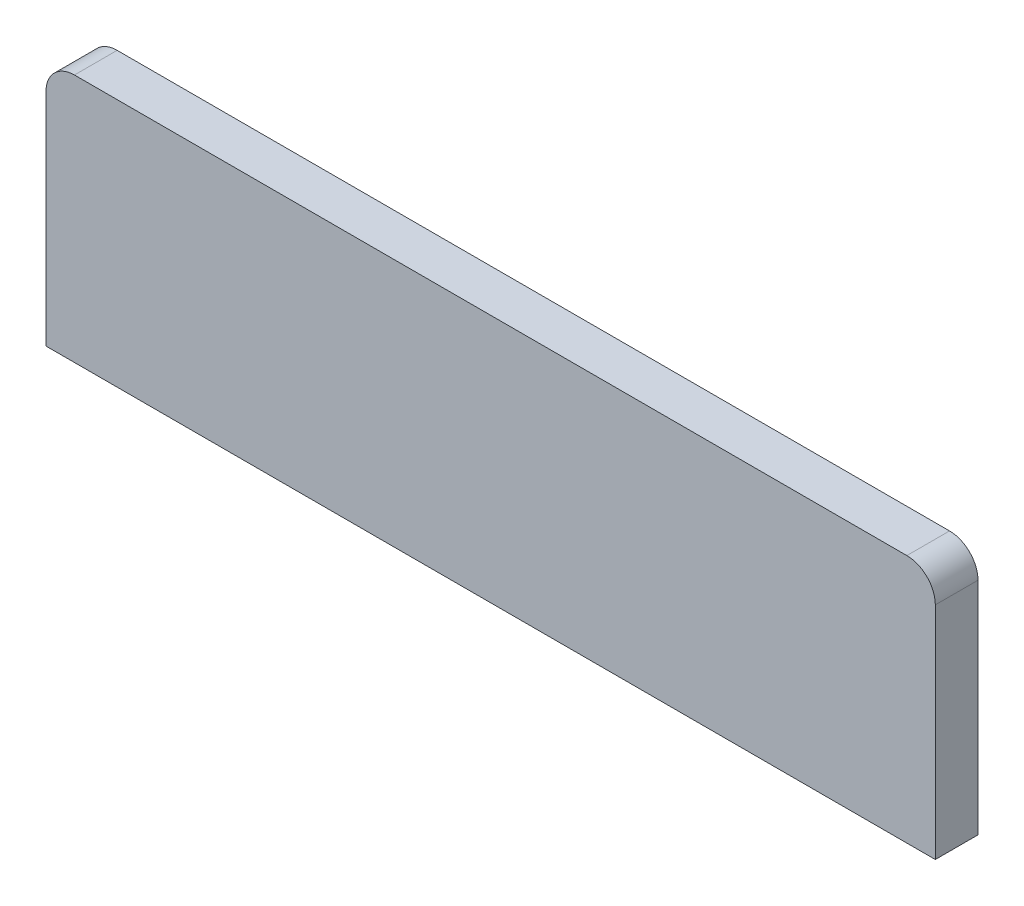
ISO-10303-21;
HEADER;
FILE_DESCRIPTION(('STEP AP214'),'2;1');
FILE_NAME('part.step','',(''),(''),'','','');
FILE_SCHEMA(('AUTOMOTIVE_DESIGN { 1 0 10303 214 1 1 1 1 }'));
ENDSEC;
DATA;
#1=APPLICATION_CONTEXT('core data for automotive mechanical design processes');
#2=APPLICATION_PROTOCOL_DEFINITION('international standard','automotive_design',2000,#1);
#3=PRODUCT_CONTEXT('',#1,'mechanical');
#4=PRODUCT('Part','Part','',(#3));
#5=PRODUCT_RELATED_PRODUCT_CATEGORY('part','',(#4));
#6=PRODUCT_DEFINITION_FORMATION('','',#4);
#7=PRODUCT_DEFINITION_CONTEXT('part definition',#1,'design');
#8=PRODUCT_DEFINITION('design','',#6,#7);
#9=PRODUCT_DEFINITION_SHAPE('','',#8);
#10=(LENGTH_UNIT() NAMED_UNIT(*) SI_UNIT(.MILLI.,.METRE.));
#11=(NAMED_UNIT(*) PLANE_ANGLE_UNIT() SI_UNIT($,.RADIAN.));
#12=(NAMED_UNIT(*) SI_UNIT($,.STERADIAN.) SOLID_ANGLE_UNIT());
#13=UNCERTAINTY_MEASURE_WITH_UNIT(LENGTH_MEASURE(1.E-05),#10,'distance_accuracy_value','');
#14=(GEOMETRIC_REPRESENTATION_CONTEXT(3) GLOBAL_UNCERTAINTY_ASSIGNED_CONTEXT((#13)) GLOBAL_UNIT_ASSIGNED_CONTEXT((#10,
#11,#12)) REPRESENTATION_CONTEXT('',''));
#15=CARTESIAN_POINT('',(0.,0.,0.));
#16=DIRECTION('',(0.,0.,1.));
#17=DIRECTION('',(1.,0.,0.));
#18=AXIS2_PLACEMENT_3D('',#15,#16,#17);
#19=CARTESIAN_POINT('',(0.,0.,12.));
#20=DIRECTION('',(1.,0.,0.));
#21=DIRECTION('',(0.,0.,-1.));
#22=AXIS2_PLACEMENT_3D('',#19,#20,#21);
#23=PLANE('',#22);
#24=DIRECTION('',(0.,-1.,0.));
#25=VECTOR('',#24,1.);
#26=CARTESIAN_POINT('',(0.,0.,0.));
#27=LINE('',#26,#25);
#28=CARTESIAN_POINT('',(0.,62.,0.));
#29=VERTEX_POINT('',#28);
#30=CARTESIAN_POINT('',(0.,0.,0.));
#31=VERTEX_POINT('',#30);
#32=EDGE_CURVE('E117',#29,#31,#27,.T.);
#33=ORIENTED_EDGE('',*,*,#32,.T.);
#34=DIRECTION('',(0.,0.,-1.));
#35=VECTOR('',#34,1.);
#36=CARTESIAN_POINT('',(0.,0.,12.));
#37=LINE('',#36,#35);
#38=CARTESIAN_POINT('',(0.,0.,12.));
#39=VERTEX_POINT('',#38);
#40=EDGE_CURVE('E11',#39,#31,#37,.T.);
#41=ORIENTED_EDGE('',*,*,#40,.F.);
#42=DIRECTION('',(0.,-1.,0.));
#43=VECTOR('',#42,1.);
#44=CARTESIAN_POINT('',(0.,0.,12.));
#45=LINE('',#44,#43);
#46=CARTESIAN_POINT('',(0.,62.,12.));
#47=VERTEX_POINT('',#46);
#48=EDGE_CURVE('E127',#47,#39,#45,.T.);
#49=ORIENTED_EDGE('',*,*,#48,.F.);
#50=DIRECTION('',(0.,0.,-1.));
#51=VECTOR('',#50,1.);
#52=CARTESIAN_POINT('',(0.,62.,12.));
#53=LINE('',#52,#51);
#54=EDGE_CURVE('E113',#47,#29,#53,.T.);
#55=ORIENTED_EDGE('',*,*,#54,.T.);
#56=EDGE_LOOP('',(#33,#41,#49,#55));
#57=FACE_BOUND('',#56,.T.);
#58=ADVANCED_FACE('F33',(#57),#23,.F.);
#59=CARTESIAN_POINT('',(0.,0.,12.));
#60=DIRECTION('',(0.,1.,0.));
#61=DIRECTION('',(0.,0.,1.));
#62=AXIS2_PLACEMENT_3D('',#59,#60,#61);
#63=PLANE('',#62);
#64=DIRECTION('',(1.,0.,0.));
#65=VECTOR('',#64,1.);
#66=CARTESIAN_POINT('',(0.,0.,0.));
#67=LINE('',#66,#65);
#68=CARTESIAN_POINT('',(250.,0.,0.));
#69=VERTEX_POINT('',#68);
#70=EDGE_CURVE('E120',#31,#69,#67,.T.);
#71=ORIENTED_EDGE('',*,*,#70,.T.);
#72=DIRECTION('',(0.,0.,-1.));
#73=VECTOR('',#72,1.);
#74=CARTESIAN_POINT('',(250.,0.,12.));
#75=LINE('',#74,#73);
#76=CARTESIAN_POINT('',(250.,0.,12.));
#77=VERTEX_POINT('',#76);
#78=EDGE_CURVE('E41',#77,#69,#75,.T.);
#79=ORIENTED_EDGE('',*,*,#78,.F.);
#80=DIRECTION('',(1.,0.,0.));
#81=VECTOR('',#80,1.);
#82=CARTESIAN_POINT('',(0.,0.,12.));
#83=LINE('',#82,#81);
#84=EDGE_CURVE('E86',#39,#77,#83,.T.);
#85=ORIENTED_EDGE('',*,*,#84,.F.);
#86=ORIENTED_EDGE('',*,*,#40,.T.);
#87=EDGE_LOOP('',(#71,#79,#85,#86));
#88=FACE_BOUND('',#87,.T.);
#89=ADVANCED_FACE('F151',(#88),#63,.F.);
#90=CARTESIAN_POINT('',(250.,0.,12.));
#91=DIRECTION('',(-1.,0.,0.));
#92=DIRECTION('',(0.,0.,1.));
#93=AXIS2_PLACEMENT_3D('',#90,#91,#92);
#94=PLANE('',#93);
#95=DIRECTION('',(0.,1.,0.));
#96=VECTOR('',#95,1.);
#97=CARTESIAN_POINT('',(250.,0.,0.));
#98=LINE('',#97,#96);
#99=CARTESIAN_POINT('',(250.,62.,0.));
#100=VERTEX_POINT('',#99);
#101=EDGE_CURVE('E122',#69,#100,#98,.T.);
#102=ORIENTED_EDGE('',*,*,#101,.T.);
#103=DIRECTION('',(0.,0.,-1.));
#104=VECTOR('',#103,1.);
#105=CARTESIAN_POINT('',(250.,62.,12.));
#106=LINE('',#105,#104);
#107=CARTESIAN_POINT('',(250.,62.,12.));
#108=VERTEX_POINT('',#107);
#109=EDGE_CURVE('E108',#108,#100,#106,.T.);
#110=ORIENTED_EDGE('',*,*,#109,.F.);
#111=DIRECTION('',(0.,1.,0.));
#112=VECTOR('',#111,1.);
#113=CARTESIAN_POINT('',(250.,0.,12.));
#114=LINE('',#113,#112);
#115=EDGE_CURVE('E99',#77,#108,#114,.T.);
#116=ORIENTED_EDGE('',*,*,#115,.F.);
#117=ORIENTED_EDGE('',*,*,#78,.T.);
#118=EDGE_LOOP('',(#102,#110,#116,#117));
#119=FACE_BOUND('',#118,.T.);
#120=ADVANCED_FACE('F133',(#119),#94,.F.);
#121=CARTESIAN_POINT('',(242.,62.,12.));
#122=DIRECTION('',(0.,0.,-1.));
#123=DIRECTION('',(-1.,0.,0.));
#124=AXIS2_PLACEMENT_3D('',#121,#122,#123);
#125=CYLINDRICAL_SURFACE('',#124,8.);
#126=CARTESIAN_POINT('',(242.,62.,0.));
#127=DIRECTION('',(0.,0.,1.));
#128=DIRECTION('',(-1.,0.,0.));
#129=AXIS2_PLACEMENT_3D('',#126,#127,#128);
#130=CIRCLE('',#129,8.);
#131=CARTESIAN_POINT('',(242.,70.,0.));
#132=VERTEX_POINT('',#131);
#133=EDGE_CURVE('E107',#100,#132,#130,.T.);
#134=ORIENTED_EDGE('',*,*,#133,.T.);
#135=DIRECTION('',(0.,0.,-1.));
#136=VECTOR('',#135,1.);
#137=CARTESIAN_POINT('',(242.,70.,12.));
#138=LINE('',#137,#136);
#139=CARTESIAN_POINT('',(242.,70.,12.));
#140=VERTEX_POINT('',#139);
#141=EDGE_CURVE('E104',#140,#132,#138,.T.);
#142=ORIENTED_EDGE('',*,*,#141,.F.);
#143=CARTESIAN_POINT('',(242.,62.,12.));
#144=DIRECTION('',(0.,0.,1.));
#145=DIRECTION('',(-1.,0.,0.));
#146=AXIS2_PLACEMENT_3D('',#143,#144,#145);
#147=CIRCLE('',#146,8.);
#148=EDGE_CURVE('E93',#108,#140,#147,.T.);
#149=ORIENTED_EDGE('',*,*,#148,.F.);
#150=ORIENTED_EDGE('',*,*,#109,.T.);
#151=EDGE_LOOP('',(#134,#142,#149,#150));
#152=FACE_BOUND('',#151,.T.);
#153=ADVANCED_FACE('F105',(#152),#125,.T.);
#154=CARTESIAN_POINT('',(8.00000000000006,70.,12.));
#155=DIRECTION('',(0.,-1.,0.));
#156=DIRECTION('',(0.,0.,-1.));
#157=AXIS2_PLACEMENT_3D('',#154,#155,#156);
#158=PLANE('',#157);
#159=DIRECTION('',(-1.,0.,0.));
#160=VECTOR('',#159,1.);
#161=CARTESIAN_POINT('',(8.00000000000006,70.,0.));
#162=LINE('',#161,#160);
#163=CARTESIAN_POINT('',(8.00000000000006,70.,0.));
#164=VERTEX_POINT('',#163);
#165=EDGE_CURVE('E72',#132,#164,#162,.T.);
#166=ORIENTED_EDGE('',*,*,#165,.T.);
#167=DIRECTION('',(0.,0.,-1.));
#168=VECTOR('',#167,1.);
#169=CARTESIAN_POINT('',(8.00000000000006,70.,12.));
#170=LINE('',#169,#168);
#171=CARTESIAN_POINT('',(8.00000000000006,70.,12.));
#172=VERTEX_POINT('',#171);
#173=EDGE_CURVE('E109',#172,#164,#170,.T.);
#174=ORIENTED_EDGE('',*,*,#173,.F.);
#175=DIRECTION('',(-1.,0.,0.));
#176=VECTOR('',#175,1.);
#177=CARTESIAN_POINT('',(8.00000000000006,70.,12.));
#178=LINE('',#177,#176);
#179=EDGE_CURVE('E97',#140,#172,#178,.T.);
#180=ORIENTED_EDGE('',*,*,#179,.F.);
#181=ORIENTED_EDGE('',*,*,#141,.T.);
#182=EDGE_LOOP('',(#166,#174,#180,#181));
#183=FACE_BOUND('',#182,.T.);
#184=ADVANCED_FACE('F111',(#183),#158,.F.);
#185=CARTESIAN_POINT('',(8.,62.,12.));
#186=DIRECTION('',(0.,0.,-1.));
#187=DIRECTION('',(-1.,0.,0.));
#188=AXIS2_PLACEMENT_3D('',#185,#186,#187);
#189=CYLINDRICAL_SURFACE('',#188,8.);
#190=CARTESIAN_POINT('',(8.,62.,0.));
#191=DIRECTION('',(0.,0.,1.));
#192=DIRECTION('',(-1.,0.,0.));
#193=AXIS2_PLACEMENT_3D('',#190,#191,#192);
#194=CIRCLE('',#193,8.);
#195=EDGE_CURVE('E78',#164,#29,#194,.T.);
#196=ORIENTED_EDGE('',*,*,#195,.T.);
#197=ORIENTED_EDGE('',*,*,#54,.F.);
#198=CARTESIAN_POINT('',(8.,62.,12.));
#199=DIRECTION('',(0.,0.,1.));
#200=DIRECTION('',(-1.,0.,0.));
#201=AXIS2_PLACEMENT_3D('',#198,#199,#200);
#202=CIRCLE('',#201,8.);
#203=EDGE_CURVE('E49',#172,#47,#202,.T.);
#204=ORIENTED_EDGE('',*,*,#203,.F.);
#205=ORIENTED_EDGE('',*,*,#173,.T.);
#206=EDGE_LOOP('',(#196,#197,#204,#205));
#207=FACE_BOUND('',#206,.T.);
#208=ADVANCED_FACE('F140',(#207),#189,.T.);
#209=CARTESIAN_POINT('',(8.,62.,12.));
#210=DIRECTION('',(0.,0.,-1.));
#211=DIRECTION('',(-1.,0.,0.));
#212=AXIS2_PLACEMENT_3D('',#209,#210,#211);
#213=PLANE('',#212);
#214=ORIENTED_EDGE('',*,*,#48,.T.);
#215=ORIENTED_EDGE('',*,*,#84,.T.);
#216=ORIENTED_EDGE('',*,*,#115,.T.);
#217=ORIENTED_EDGE('',*,*,#148,.T.);
#218=ORIENTED_EDGE('',*,*,#179,.T.);
#219=ORIENTED_EDGE('',*,*,#203,.T.);
#220=EDGE_LOOP('',(#214,#215,#216,#217,#218,#219));
#221=FACE_BOUND('',#220,.T.);
#222=ADVANCED_FACE('F95',(#221),#213,.F.);
#223=CARTESIAN_POINT('',(8.,62.,0.));
#224=DIRECTION('',(0.,0.,-1.));
#225=DIRECTION('',(-1.,0.,0.));
#226=AXIS2_PLACEMENT_3D('',#223,#224,#225);
#227=PLANE('',#226);
#228=ORIENTED_EDGE('',*,*,#32,.F.);
#229=ORIENTED_EDGE('',*,*,#195,.F.);
#230=ORIENTED_EDGE('',*,*,#165,.F.);
#231=ORIENTED_EDGE('',*,*,#133,.F.);
#232=ORIENTED_EDGE('',*,*,#101,.F.);
#233=ORIENTED_EDGE('',*,*,#70,.F.);
#234=EDGE_LOOP('',(#228,#229,#230,#231,#232,#233));
#235=FACE_BOUND('',#234,.T.);
#236=ADVANCED_FACE('F136',(#235),#227,.T.);
#237=CLOSED_SHELL('',(#58,#89,#120,#153,#184,#208,#222,#236));
#238=MANIFOLD_SOLID_BREP('B2',#237);
#239=ADVANCED_BREP_SHAPE_REPRESENTATION('',(#18,#238),#14);
#240=SHAPE_DEFINITION_REPRESENTATION(#9,#239);
ENDSEC;
END-ISO-10303-21;
